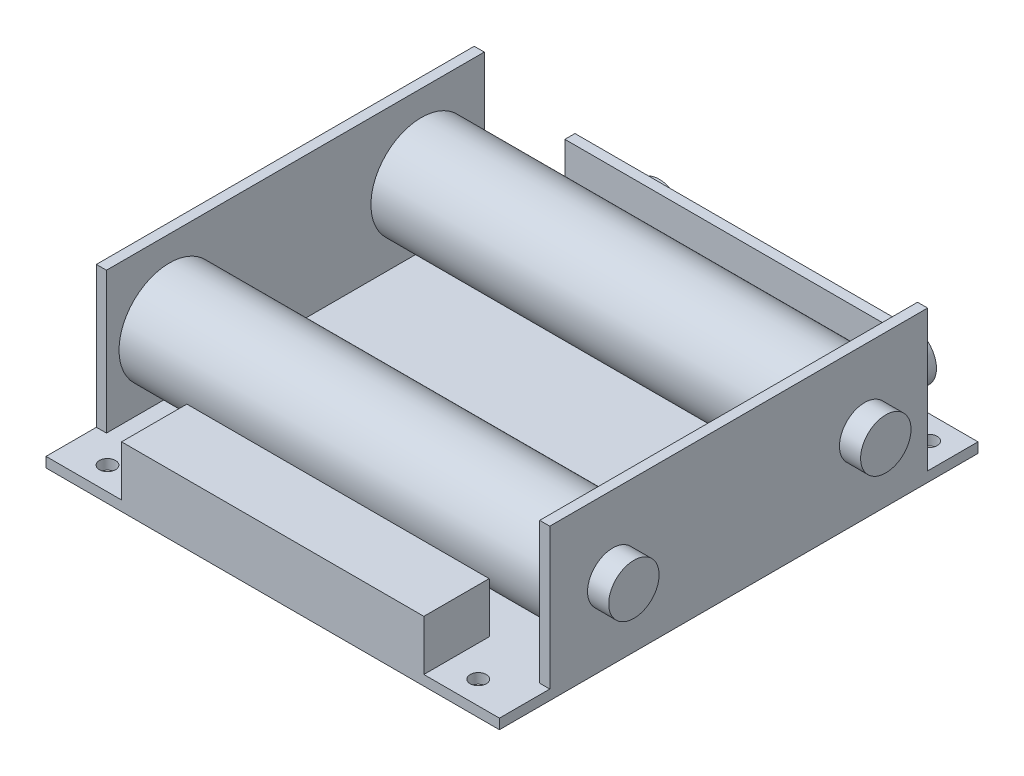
from build123d import *

# Parameters (mm, degrees)
SKETCH1_W                  = 90
SKETCH1_H                  = 95
BOSS_EXTRUDE1_DEPTH        = 2
F_3_2_3_2_DIAMETER_HOLE1_D = 3.2
SKETCH4_W                  = 75
SKETCH4_H                  = 30
BOSS_EXTRUDE2_DEPTH        = 2
BOSS_EXTRUDE3_DEPTH        = 4.2
BOSS_EXTRUDE3_DEPTH_BACK   = 94.2
SKETCH5_R                  = 5
SKETCH6_W                  = 60
SKETCH6_H                  = 13
BOSS_EXTRUDE4_DEPTH        = 10
SKETCH7_W                  = 70
SKETCH7_H                  = 15
BOSS_EXTRUDE5_DEPTH        = 2
SKETCH8_R                  = 5
BOSS_EXTRUDE6_DEPTH        = 4.2


with BuildPart() as part:
    # Sketch1 → Boss-Extrude1 (new body)
    with BuildSketch(Plane(origin=(0, 0, 0), x_dir=(1, 0, 0), z_dir=(0, 1, 0))):
        Rectangle(SKETCH1_W, SKETCH1_H)
    extrude(amount=BOSS_EXTRUDE1_DEPTH)

    # 3.2 _3.2_ Diameter Hole1 (through all)
    with Locations(Plane(origin=(0, 0, 0), x_dir=(-1, 0, 0), z_dir=(0, -1, 0))):
        with Locations((37.4, -42.9), (-36.2, -42.9), (-40, 42.8), (40, 42.8)):
            Hole(F_3_2_3_2_DIAMETER_HOLE1_D / 2)

    # Sketch4 → Boss-Extrude2 (add)
    with BuildSketch(Plane(origin=(45, 0, 0), x_dir=(0, 0, -1), z_dir=(1, 0, 0))):
        with Locations((0, 15)):
            Rectangle(SKETCH4_W, SKETCH4_H)
    boss_extrude2 = extrude(amount=-BOSS_EXTRUDE2_DEPTH)

    # Mirror1: Boss-Extrude2 across plane
    add(boss_extrude2.mirror(Plane(origin=(0, 0, 0), x_dir=(0, 0, 1), z_dir=(1, 0, 0))))

    # Sketch5 → Boss-Extrude3 (add, two sides: drawn at the far end of the back side and taken through both)
    with BuildSketch(Plane(origin=(45, 0, 0), x_dir=(0, 0, -1), z_dir=(1, 0, 0)).offset(-BOSS_EXTRUDE3_DEPTH_BACK)):
        with Locations((-25, 15)):
            Circle(SKETCH5_R)
        with Locations((25, 15)):
            Circle(SKETCH5_R)
    extrude(amount=BOSS_EXTRUDE3_DEPTH + BOSS_EXTRUDE3_DEPTH_BACK)

    # Sketch6 → Boss-Extrude4 (add)
    with BuildSketch(Plane(origin=(0, 2, 0), x_dir=(1, 0, 0), z_dir=(0, 1, 0))):
        with Locations((0, -41)):
            Rectangle(SKETCH6_W, SKETCH6_H)
    extrude(amount=BOSS_EXTRUDE4_DEPTH)

    # Sketch7 → Boss-Extrude5 (add)
    with BuildSketch(Plane(origin=(0, 0, -47.5), x_dir=(-1, 0, 0), z_dir=(0, 0, -1))):
        with Locations((0, 7.5)):
            Rectangle(SKETCH7_W, SKETCH7_H)
    extrude(amount=-BOSS_EXTRUDE5_DEPTH)

    # Sketch8 → Boss-Extrude6 (add)
    with BuildSketch(Plane(origin=(0, 0, -47.5), x_dir=(-1, 0, 0), z_dir=(0, 0, -1))):
        with Locations(Location((-27.55, 6.3, 0), (0, 0, 180))):
            Circle(SKETCH8_R)
        with Locations(Location((22.45, 6.3, 0), (0, 0, 180))):
            Circle(SKETCH8_R)
    extrude(amount=BOSS_EXTRUDE6_DEPTH)


solid = part.part
